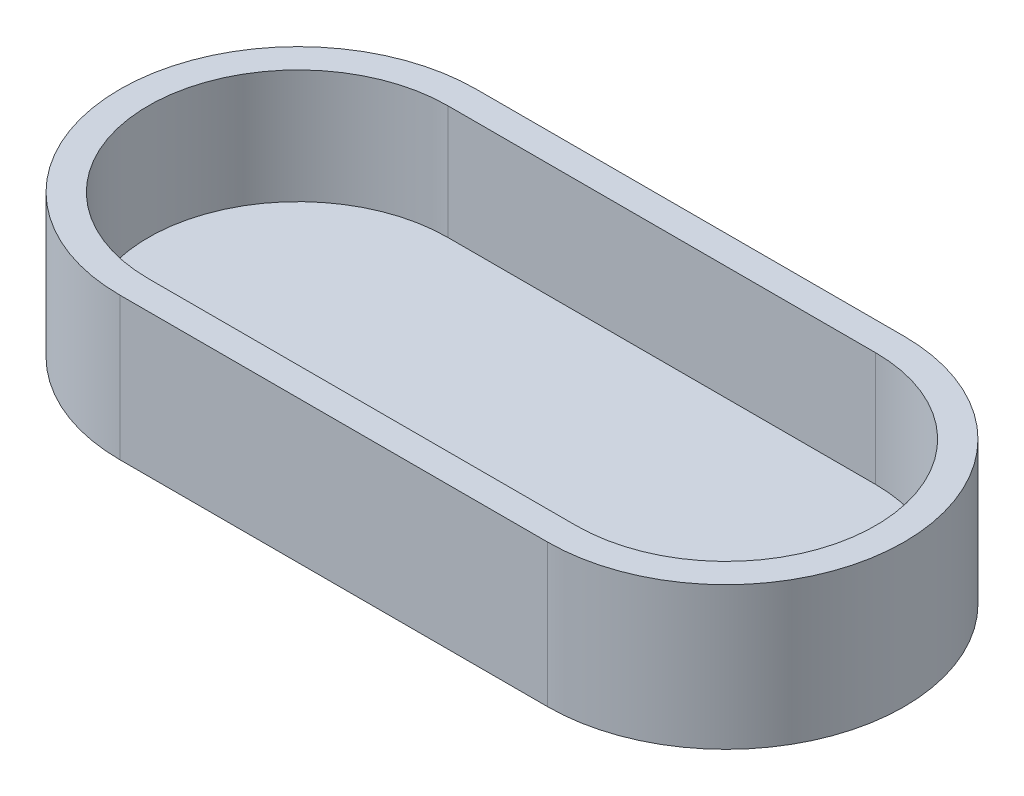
ISO-10303-21;
HEADER;
FILE_DESCRIPTION(('STEP AP214'),'2;1');
FILE_NAME('part.step','',(''),(''),'','','');
FILE_SCHEMA(('AUTOMOTIVE_DESIGN { 1 0 10303 214 1 1 1 1 }'));
ENDSEC;
DATA;
#1=APPLICATION_CONTEXT('core data for automotive mechanical design processes');
#2=APPLICATION_PROTOCOL_DEFINITION('international standard','automotive_design',2000,#1);
#3=PRODUCT_CONTEXT('',#1,'mechanical');
#4=PRODUCT('Part','Part','',(#3));
#5=PRODUCT_RELATED_PRODUCT_CATEGORY('part','',(#4));
#6=PRODUCT_DEFINITION_FORMATION('','',#4);
#7=PRODUCT_DEFINITION_CONTEXT('part definition',#1,'design');
#8=PRODUCT_DEFINITION('design','',#6,#7);
#9=PRODUCT_DEFINITION_SHAPE('','',#8);
#10=(LENGTH_UNIT() NAMED_UNIT(*) SI_UNIT(.MILLI.,.METRE.));
#11=(NAMED_UNIT(*) PLANE_ANGLE_UNIT() SI_UNIT($,.RADIAN.));
#12=(NAMED_UNIT(*) SI_UNIT($,.STERADIAN.) SOLID_ANGLE_UNIT());
#13=UNCERTAINTY_MEASURE_WITH_UNIT(LENGTH_MEASURE(1.E-05),#10,'distance_accuracy_value','');
#14=(GEOMETRIC_REPRESENTATION_CONTEXT(3) GLOBAL_UNCERTAINTY_ASSIGNED_CONTEXT((#13)) GLOBAL_UNIT_ASSIGNED_CONTEXT((#10,
#11,#12)) REPRESENTATION_CONTEXT('',''));
#15=CARTESIAN_POINT('',(0.,0.,0.));
#16=DIRECTION('',(0.,0.,1.));
#17=DIRECTION('',(1.,0.,0.));
#18=AXIS2_PLACEMENT_3D('',#15,#16,#17);
#19=CARTESIAN_POINT('',(0.,20.,-25.));
#20=DIRECTION('',(0.,-1.,0.));
#21=DIRECTION('',(0.,0.,-1.));
#22=AXIS2_PLACEMENT_3D('',#19,#20,#21);
#23=CYLINDRICAL_SURFACE('',#22,25.);
#24=CARTESIAN_POINT('',(0.,0.,-25.));
#25=DIRECTION('',(0.,1.,0.));
#26=DIRECTION('',(0.,0.,1.));
#27=AXIS2_PLACEMENT_3D('',#24,#25,#26);
#28=CIRCLE('',#27,25.);
#29=CARTESIAN_POINT('',(0.,0.,-50.));
#30=VERTEX_POINT('',#29);
#31=CARTESIAN_POINT('',(0.,0.,0.));
#32=VERTEX_POINT('',#31);
#33=EDGE_CURVE('E132',#30,#32,#28,.T.);
#34=ORIENTED_EDGE('',*,*,#33,.T.);
#35=DIRECTION('',(0.,-1.,0.));
#36=VECTOR('',#35,1.);
#37=CARTESIAN_POINT('',(0.,20.,0.));
#38=LINE('',#37,#36);
#39=CARTESIAN_POINT('',(0.,20.,0.));
#40=VERTEX_POINT('',#39);
#41=EDGE_CURVE('E11',#40,#32,#38,.T.);
#42=ORIENTED_EDGE('',*,*,#41,.F.);
#43=CARTESIAN_POINT('',(0.,20.,-25.));
#44=DIRECTION('',(0.,1.,0.));
#45=DIRECTION('',(0.,0.,1.));
#46=AXIS2_PLACEMENT_3D('',#43,#44,#45);
#47=CIRCLE('',#46,25.);
#48=CARTESIAN_POINT('',(0.,20.,-50.));
#49=VERTEX_POINT('',#48);
#50=EDGE_CURVE('E141',#49,#40,#47,.T.);
#51=ORIENTED_EDGE('',*,*,#50,.F.);
#52=DIRECTION('',(0.,-1.,0.));
#53=VECTOR('',#52,1.);
#54=CARTESIAN_POINT('',(0.,20.,-50.));
#55=LINE('',#54,#53);
#56=EDGE_CURVE('E148',#49,#30,#55,.T.);
#57=ORIENTED_EDGE('',*,*,#56,.T.);
#58=EDGE_LOOP('',(#34,#42,#51,#57));
#59=FACE_BOUND('',#58,.T.);
#60=ADVANCED_FACE('F33',(#59),#23,.T.);
#61=CARTESIAN_POINT('',(0.,20.,0.));
#62=DIRECTION('',(0.,0.,-1.));
#63=DIRECTION('',(-1.,0.,0.));
#64=AXIS2_PLACEMENT_3D('',#61,#62,#63);
#65=PLANE('',#64);
#66=DIRECTION('',(1.,0.,0.));
#67=VECTOR('',#66,1.);
#68=CARTESIAN_POINT('',(0.,0.,0.));
#69=LINE('',#68,#67);
#70=CARTESIAN_POINT('',(60.,0.,0.));
#71=VERTEX_POINT('',#70);
#72=EDGE_CURVE('E135',#32,#71,#69,.T.);
#73=ORIENTED_EDGE('',*,*,#72,.T.);
#74=DIRECTION('',(0.,-1.,0.));
#75=VECTOR('',#74,1.);
#76=CARTESIAN_POINT('',(60.,20.,0.));
#77=LINE('',#76,#75);
#78=CARTESIAN_POINT('',(60.,20.,0.));
#79=VERTEX_POINT('',#78);
#80=EDGE_CURVE('E40',#79,#71,#77,.T.);
#81=ORIENTED_EDGE('',*,*,#80,.F.);
#82=DIRECTION('',(1.,0.,0.));
#83=VECTOR('',#82,1.);
#84=CARTESIAN_POINT('',(0.,20.,0.));
#85=LINE('',#84,#83);
#86=EDGE_CURVE('E143',#40,#79,#85,.T.);
#87=ORIENTED_EDGE('',*,*,#86,.F.);
#88=ORIENTED_EDGE('',*,*,#41,.T.);
#89=EDGE_LOOP('',(#73,#81,#87,#88));
#90=FACE_BOUND('',#89,.T.);
#91=ADVANCED_FACE('F171',(#90),#65,.F.);
#92=CARTESIAN_POINT('',(60.,20.,-25.));
#93=DIRECTION('',(0.,-1.,0.));
#94=DIRECTION('',(0.,0.,-1.));
#95=AXIS2_PLACEMENT_3D('',#92,#93,#94);
#96=CYLINDRICAL_SURFACE('',#95,25.);
#97=CARTESIAN_POINT('',(60.,0.,-25.));
#98=DIRECTION('',(0.,1.,0.));
#99=DIRECTION('',(0.,0.,1.));
#100=AXIS2_PLACEMENT_3D('',#97,#98,#99);
#101=CIRCLE('',#100,25.);
#102=CARTESIAN_POINT('',(60.,0.,-50.));
#103=VERTEX_POINT('',#102);
#104=EDGE_CURVE('E137',#71,#103,#101,.T.);
#105=ORIENTED_EDGE('',*,*,#104,.T.);
#106=DIRECTION('',(0.,-1.,0.));
#107=VECTOR('',#106,1.);
#108=CARTESIAN_POINT('',(60.,20.,-50.));
#109=LINE('',#108,#107);
#110=CARTESIAN_POINT('',(60.,20.,-50.));
#111=VERTEX_POINT('',#110);
#112=EDGE_CURVE('E151',#111,#103,#109,.T.);
#113=ORIENTED_EDGE('',*,*,#112,.F.);
#114=CARTESIAN_POINT('',(60.,20.,-25.));
#115=DIRECTION('',(0.,1.,0.));
#116=DIRECTION('',(0.,0.,1.));
#117=AXIS2_PLACEMENT_3D('',#114,#115,#116);
#118=CIRCLE('',#117,25.);
#119=EDGE_CURVE('E145',#79,#111,#118,.T.);
#120=ORIENTED_EDGE('',*,*,#119,.F.);
#121=ORIENTED_EDGE('',*,*,#80,.T.);
#122=EDGE_LOOP('',(#105,#113,#120,#121));
#123=FACE_BOUND('',#122,.T.);
#124=ADVANCED_FACE('F158',(#123),#96,.T.);
#125=CARTESIAN_POINT('',(60.,20.,-50.));
#126=DIRECTION('',(0.,0.,1.));
#127=DIRECTION('',(1.,0.,0.));
#128=AXIS2_PLACEMENT_3D('',#125,#126,#127);
#129=PLANE('',#128);
#130=DIRECTION('',(-1.,0.,0.));
#131=VECTOR('',#130,1.);
#132=CARTESIAN_POINT('',(60.,0.,-50.));
#133=LINE('',#132,#131);
#134=EDGE_CURVE('E139',#103,#30,#133,.T.);
#135=ORIENTED_EDGE('',*,*,#134,.T.);
#136=ORIENTED_EDGE('',*,*,#56,.F.);
#137=DIRECTION('',(-1.,0.,0.));
#138=VECTOR('',#137,1.);
#139=CARTESIAN_POINT('',(60.,20.,-50.));
#140=LINE('',#139,#138);
#141=EDGE_CURVE('E55',#111,#49,#140,.T.);
#142=ORIENTED_EDGE('',*,*,#141,.F.);
#143=ORIENTED_EDGE('',*,*,#112,.T.);
#144=EDGE_LOOP('',(#135,#136,#142,#143));
#145=FACE_BOUND('',#144,.T.);
#146=ADVANCED_FACE('F166',(#145),#129,.F.);
#147=CARTESIAN_POINT('',(0.,20.,-25.));
#148=DIRECTION('',(0.,1.,0.));
#149=DIRECTION('',(0.,0.,1.));
#150=AXIS2_PLACEMENT_3D('',#147,#148,#149);
#151=PLANE('',#150);
#152=CARTESIAN_POINT('',(0.,20.,-25.));
#153=DIRECTION('',(0.,1.,0.));
#154=DIRECTION('',(0.,0.,1.));
#155=AXIS2_PLACEMENT_3D('',#152,#153,#154);
#156=CIRCLE('',#155,21.);
#157=CARTESIAN_POINT('',(0.,20.,-46.));
#158=VERTEX_POINT('',#157);
#159=CARTESIAN_POINT('',(0.,20.,-4.));
#160=VERTEX_POINT('',#159);
#161=EDGE_CURVE('E121',#158,#160,#156,.T.);
#162=ORIENTED_EDGE('',*,*,#161,.F.);
#163=DIRECTION('',(-1.,0.,0.));
#164=VECTOR('',#163,1.);
#165=CARTESIAN_POINT('',(60.,20.,-46.));
#166=LINE('',#165,#164);
#167=CARTESIAN_POINT('',(60.,20.,-46.));
#168=VERTEX_POINT('',#167);
#169=EDGE_CURVE('E130',#168,#158,#166,.T.);
#170=ORIENTED_EDGE('',*,*,#169,.F.);
#171=CARTESIAN_POINT('',(60.,20.,-25.));
#172=DIRECTION('',(0.,1.,0.));
#173=DIRECTION('',(0.,0.,1.));
#174=AXIS2_PLACEMENT_3D('',#171,#172,#173);
#175=CIRCLE('',#174,21.);
#176=CARTESIAN_POINT('',(60.,20.,-4.));
#177=VERTEX_POINT('',#176);
#178=EDGE_CURVE('E128',#177,#168,#175,.T.);
#179=ORIENTED_EDGE('',*,*,#178,.F.);
#180=DIRECTION('',(1.,0.,0.));
#181=VECTOR('',#180,1.);
#182=CARTESIAN_POINT('',(0.,20.,-4.));
#183=LINE('',#182,#181);
#184=EDGE_CURVE('E113',#160,#177,#183,.T.);
#185=ORIENTED_EDGE('',*,*,#184,.F.);
#186=EDGE_LOOP('',(#162,#170,#179,#185));
#187=FACE_BOUND('',#186,.T.);
#188=ORIENTED_EDGE('',*,*,#50,.T.);
#189=ORIENTED_EDGE('',*,*,#86,.T.);
#190=ORIENTED_EDGE('',*,*,#119,.T.);
#191=ORIENTED_EDGE('',*,*,#141,.T.);
#192=EDGE_LOOP('',(#188,#189,#190,#191));
#193=FACE_BOUND('',#192,.T.);
#194=ADVANCED_FACE('F170',(#187,#193),#151,.T.);
#195=CARTESIAN_POINT('',(0.,0.,-25.));
#196=DIRECTION('',(0.,1.,0.));
#197=DIRECTION('',(0.,0.,1.));
#198=AXIS2_PLACEMENT_3D('',#195,#196,#197);
#199=PLANE('',#198);
#200=ORIENTED_EDGE('',*,*,#33,.F.);
#201=ORIENTED_EDGE('',*,*,#134,.F.);
#202=ORIENTED_EDGE('',*,*,#104,.F.);
#203=ORIENTED_EDGE('',*,*,#72,.F.);
#204=EDGE_LOOP('',(#200,#201,#202,#203));
#205=FACE_BOUND('',#204,.T.);
#206=ADVANCED_FACE('F164',(#205),#199,.F.);
#207=CARTESIAN_POINT('',(0.,20.,-25.));
#208=DIRECTION('',(0.,-1.,0.));
#209=DIRECTION('',(0.,0.,-1.));
#210=AXIS2_PLACEMENT_3D('',#207,#208,#209);
#211=CYLINDRICAL_SURFACE('',#210,21.);
#212=CARTESIAN_POINT('',(0.,4.,-25.));
#213=DIRECTION('',(0.,1.,0.));
#214=DIRECTION('',(0.,0.,1.));
#215=AXIS2_PLACEMENT_3D('',#212,#213,#214);
#216=CIRCLE('',#215,21.);
#217=CARTESIAN_POINT('',(0.,4.,-46.));
#218=VERTEX_POINT('',#217);
#219=CARTESIAN_POINT('',(0.,4.,-4.));
#220=VERTEX_POINT('',#219);
#221=EDGE_CURVE('E104',#218,#220,#216,.T.);
#222=ORIENTED_EDGE('',*,*,#221,.F.);
#223=DIRECTION('',(0.,-1.,0.));
#224=VECTOR('',#223,1.);
#225=CARTESIAN_POINT('',(0.,20.,-46.));
#226=LINE('',#225,#224);
#227=EDGE_CURVE('E124',#158,#218,#226,.T.);
#228=ORIENTED_EDGE('',*,*,#227,.F.);
#229=ORIENTED_EDGE('',*,*,#161,.T.);
#230=DIRECTION('',(0.,1.,0.));
#231=VECTOR('',#230,1.);
#232=CARTESIAN_POINT('',(0.,20.,-4.));
#233=LINE('',#232,#231);
#234=EDGE_CURVE('E116',#160,#220,#233,.F.);
#235=ORIENTED_EDGE('',*,*,#234,.T.);
#236=EDGE_LOOP('',(#222,#228,#229,#235));
#237=FACE_BOUND('',#236,.T.);
#238=ADVANCED_FACE('F186',(#237),#211,.F.);
#239=CARTESIAN_POINT('',(0.,20.,-4.));
#240=DIRECTION('',(0.,0.,-1.));
#241=DIRECTION('',(-1.,0.,0.));
#242=AXIS2_PLACEMENT_3D('',#239,#240,#241);
#243=PLANE('',#242);
#244=DIRECTION('',(1.,0.,0.));
#245=VECTOR('',#244,1.);
#246=CARTESIAN_POINT('',(0.,4.,-4.));
#247=LINE('',#246,#245);
#248=CARTESIAN_POINT('',(60.,4.,-4.));
#249=VERTEX_POINT('',#248);
#250=EDGE_CURVE('E98',#220,#249,#247,.T.);
#251=ORIENTED_EDGE('',*,*,#250,.F.);
#252=ORIENTED_EDGE('',*,*,#234,.F.);
#253=ORIENTED_EDGE('',*,*,#184,.T.);
#254=DIRECTION('',(0.,-1.,0.));
#255=VECTOR('',#254,1.);
#256=CARTESIAN_POINT('',(60.,20.,-4.));
#257=LINE('',#256,#255);
#258=EDGE_CURVE('E110',#177,#249,#257,.T.);
#259=ORIENTED_EDGE('',*,*,#258,.T.);
#260=EDGE_LOOP('',(#251,#252,#253,#259));
#261=FACE_BOUND('',#260,.T.);
#262=ADVANCED_FACE('F111',(#261),#243,.T.);
#263=CARTESIAN_POINT('',(60.,20.,-25.));
#264=DIRECTION('',(0.,-1.,0.));
#265=DIRECTION('',(0.,0.,-1.));
#266=AXIS2_PLACEMENT_3D('',#263,#264,#265);
#267=CYLINDRICAL_SURFACE('',#266,21.);
#268=CARTESIAN_POINT('',(60.,4.,-25.));
#269=DIRECTION('',(0.,1.,0.));
#270=DIRECTION('',(0.,0.,1.));
#271=AXIS2_PLACEMENT_3D('',#268,#269,#270);
#272=CIRCLE('',#271,21.);
#273=CARTESIAN_POINT('',(60.,4.,-46.));
#274=VERTEX_POINT('',#273);
#275=EDGE_CURVE('E102',#249,#274,#272,.T.);
#276=ORIENTED_EDGE('',*,*,#275,.F.);
#277=ORIENTED_EDGE('',*,*,#258,.F.);
#278=ORIENTED_EDGE('',*,*,#178,.T.);
#279=DIRECTION('',(0.,1.,0.));
#280=VECTOR('',#279,1.);
#281=CARTESIAN_POINT('',(60.,20.,-46.));
#282=LINE('',#281,#280);
#283=EDGE_CURVE('E47',#168,#274,#282,.F.);
#284=ORIENTED_EDGE('',*,*,#283,.T.);
#285=EDGE_LOOP('',(#276,#277,#278,#284));
#286=FACE_BOUND('',#285,.T.);
#287=ADVANCED_FACE('F118',(#286),#267,.F.);
#288=CARTESIAN_POINT('',(60.,20.,-46.));
#289=DIRECTION('',(0.,0.,1.));
#290=DIRECTION('',(1.,0.,0.));
#291=AXIS2_PLACEMENT_3D('',#288,#289,#290);
#292=PLANE('',#291);
#293=DIRECTION('',(-1.,0.,0.));
#294=VECTOR('',#293,1.);
#295=CARTESIAN_POINT('',(60.,4.,-46.));
#296=LINE('',#295,#294);
#297=EDGE_CURVE('E119',#274,#218,#296,.T.);
#298=ORIENTED_EDGE('',*,*,#297,.F.);
#299=ORIENTED_EDGE('',*,*,#283,.F.);
#300=ORIENTED_EDGE('',*,*,#169,.T.);
#301=ORIENTED_EDGE('',*,*,#227,.T.);
#302=EDGE_LOOP('',(#298,#299,#300,#301));
#303=FACE_BOUND('',#302,.T.);
#304=ADVANCED_FACE('F189',(#303),#292,.T.);
#305=CARTESIAN_POINT('',(0.,4.,-25.));
#306=DIRECTION('',(0.,1.,0.));
#307=DIRECTION('',(0.,0.,1.));
#308=AXIS2_PLACEMENT_3D('',#305,#306,#307);
#309=PLANE('',#308);
#310=ORIENTED_EDGE('',*,*,#221,.T.);
#311=ORIENTED_EDGE('',*,*,#250,.T.);
#312=ORIENTED_EDGE('',*,*,#275,.T.);
#313=ORIENTED_EDGE('',*,*,#297,.T.);
#314=EDGE_LOOP('',(#310,#311,#312,#313));
#315=FACE_BOUND('',#314,.T.);
#316=ADVANCED_FACE('F100',(#315),#309,.T.);
#317=CLOSED_SHELL('',(#60,#91,#124,#146,#194,#206,#238,#262,#287,#304,#316));
#318=MANIFOLD_SOLID_BREP('B2',#317);
#319=ADVANCED_BREP_SHAPE_REPRESENTATION('',(#18,#318),#14);
#320=SHAPE_DEFINITION_REPRESENTATION(#9,#319);
ENDSEC;
END-ISO-10303-21;
